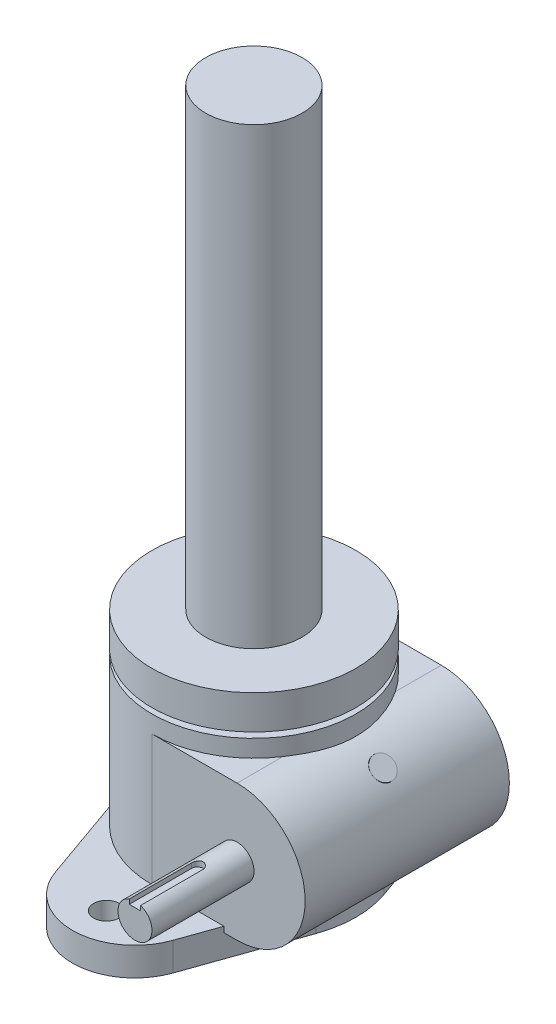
from build123d import *

# Parameters (mm, degrees)
BOSS_EXTRUDE2_DEPTH      = 28.575
BOSS_EXTRUDE2_DEPTH_BACK = 28.575
SKETCH3_W                = 85.7504
SKETCH3_H                = 4.7498
CUT_KEYWAY1_DEPTH        = 0.00254
BOSS_EXTRUDE3_START      = 7.9375
SKETCH5_R                = 3.571875
BOSS_EXTRUDE3_DEPTH      = 7.9375
CUT_KEYWAY2_REACH        = 176.107
CUT_KEYWAY2_END_RADIUS   = 4.7498


with BuildPart() as part:
    # Sketch1 → Base-Revolve (revolve)
    with BuildSketch(Plane.XY, mode=Mode.PRIVATE) as base_revolve_sk:
        Polygon((0, -9.525), (-14.2875, -9.525), (-14.2875, 0), (-28.575, 0), (-28.575, 49.276), (-22.987, 49.276), (-22.987, 50.8), (-28.575, 50.8), (-28.575, 60.325), (-13.49375, 60.325), (-13.49375, 187.325), (0, 187.325), align=None)
    revolve(base_revolve_sk.sketch.rotate(Axis((0, 0, 0), (0, 1, 0)), 270), axis=Axis((0, 0, 0), (0, 1, 0)))

    # Sketch2 → Boss-Extrude2 (add, two sides: drawn at the far end of the back side and taken through both)
    with BuildSketch(Plane.XY.offset(-BOSS_EXTRUDE2_DEPTH_BACK)):
        with BuildLine():
            Line((23.8633, 6.35), (0, 6.35))
            Line((0, 6.35), (0, 44.45))
            Line((0, 44.45), (23.8633, 44.45))
            ThreePointArc((23.8633, 44.45), (42.9133, 25.4), (23.8633, 6.35))
        make_face()
    extrude(amount=BOSS_EXTRUDE2_DEPTH + BOSS_EXTRUDE2_DEPTH_BACK)

    # Sketch3 → Boss-Revolve1 (revolve)
    with BuildSketch(Plane.ZY.offset(-23.8633), mode=Mode.PRIVATE) as boss_revolve1_sk:
        with Locations((14.2748, 23.0251)):
            Rectangle(SKETCH3_W, SKETCH3_H)
    revolve(boss_revolve1_sk.sketch.rotate(Axis((23.8633, 25.4, -105.895333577), (0, 0, 1)), 270), axis=Axis((23.8633, 25.4, -105.895333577), (0, 0, 1)))

    # Sketch8 → Cut-Keyway1 (cut)
    with BuildSketch(Plane(origin=(0, 28.5623, 0), x_dir=(-1, 0, 0), z_dir=(0, 1, 0))):
        with BuildLine():
            Line((-25.4508, -28.6004), (-22.2758, -28.6004))
            Line((-22.2758, -28.6004), (-22.2758, -11.1379))
            ThreePointArc((-22.2758, -11.1379), (-23.8633, -9.5504), (-25.4508, -11.1379))
            Line((-25.4508, -11.1379), (-25.4508, -28.6004))
        make_face()
    extrude(amount=CUT_KEYWAY1_DEPTH, mode=Mode.SUBTRACT)

    # Sketch5 → Boss-Extrude3 (add)
    with BuildSketch(Plane(origin=(0, 0, 0), x_dir=(-1, 0, 0), z_dir=(0, 1, 0)).offset(BOSS_EXTRUDE3_START)):
        with BuildLine():
            Line((26.940768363, 9.525), (16.463802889, 39.158333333))
            ThreePointArc((16.463802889, 39.158333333), (0, 50.8), (-16.463802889, 39.158333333))
            Line((-16.463802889, 39.158333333), (-26.940768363, 9.525))
            ThreePointArc((-26.940768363, 9.525), (-28.575, 0), (-26.940768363, -9.525))
            Line((-26.940768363, -9.525), (-16.463802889, -39.158333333))
            ThreePointArc((-16.463802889, -39.158333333), (0, -50.8), (16.463802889, -39.158333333))
            Line((16.463802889, -39.158333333), (26.940768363, -9.525))
            ThreePointArc((26.940768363, -9.525), (28.575, 0), (26.940768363, 9.525))
        make_face()
        with Locations(Location((0, -41.275, 0), (0, 0, 90))):
            Circle(SKETCH5_R, mode=Mode.SUBTRACT)
        with Locations(Location((0, 41.275, 0), (0, 0, 90))):
            Circle(SKETCH5_R, mode=Mode.SUBTRACT)
    extrude(amount=-BOSS_EXTRUDE3_DEPTH)

    # Sketch6 → Cut-Revolve1 (revolve, cut)
    with BuildSketch(Plane.XY, mode=Mode.PRIVATE) as cut_revolve1_sk:
        Polygon((0, 184.785), (0, -28.575), (-7.9375, -28.575), (-7.9375, 9.525), (-10.95375, 9.525), (-10.95375, 60.325), (-10.95375, 184.785), align=None)
    revolve(cut_revolve1_sk.sketch.rotate(Axis((0, 0, 0), (0, 1, 0)), 270), axis=Axis((0, 0, 0), (0, 1, 0)), mode=Mode.SUBTRACT)

    # Sketch7 → Boss-Revolve2 (revolve)
    with BuildSketch(Plane.XY):
        Polygon((34.067553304, 37.560955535), (36.499744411, 35.520104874), (38.540595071, 37.952295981), (36.108403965, 39.993146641), align=None)
    revolve(axis=Axis((23.8633, 25.4, 0), (0.6427876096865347, 0.7660444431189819, 0)))

    # Cut-Keyway2: up to this cylinder (the profile starts inside it)
    cut_keyway2_end = Plane(origin=(23.8633, 25.4, 47.791985), z_dir=(0, 0, -1)) * Cylinder(CUT_KEYWAY2_END_RADIUS, 362.7136, mode=Mode.PRIVATE)
    # Sketch10 → Cut-Keyway2 (cut, up to the surface)
    with BuildSketch(Plane(origin=(0, 28.5623, 0), x_dir=(-1, 0, 0), z_dir=(0, 1, 0)), mode=Mode.PRIVATE) as cut_keyway2_sk1:
        with BuildLine():
            Line((-22.2758, 57.15), (-25.4508, 57.15))
            Line((-25.4508, 57.15), (-25.4508, 39.6875))
            ThreePointArc((-25.4508, 39.6875), (-23.8633, 38.1), (-22.2758, 39.6875))
            Line((-22.2758, 39.6875), (-22.2758, 57.15))
        make_face()
    cut_keyway2_tool1 = extrude(cut_keyway2_sk1.sketch, amount=CUT_KEYWAY2_REACH, mode=Mode.PRIVATE) & cut_keyway2_end
    add(cut_keyway2_tool1.solids().sort_by_distance((23.8633, 28.5623, 47.791985))[0], mode=Mode.SUBTRACT)


solid = part.part
